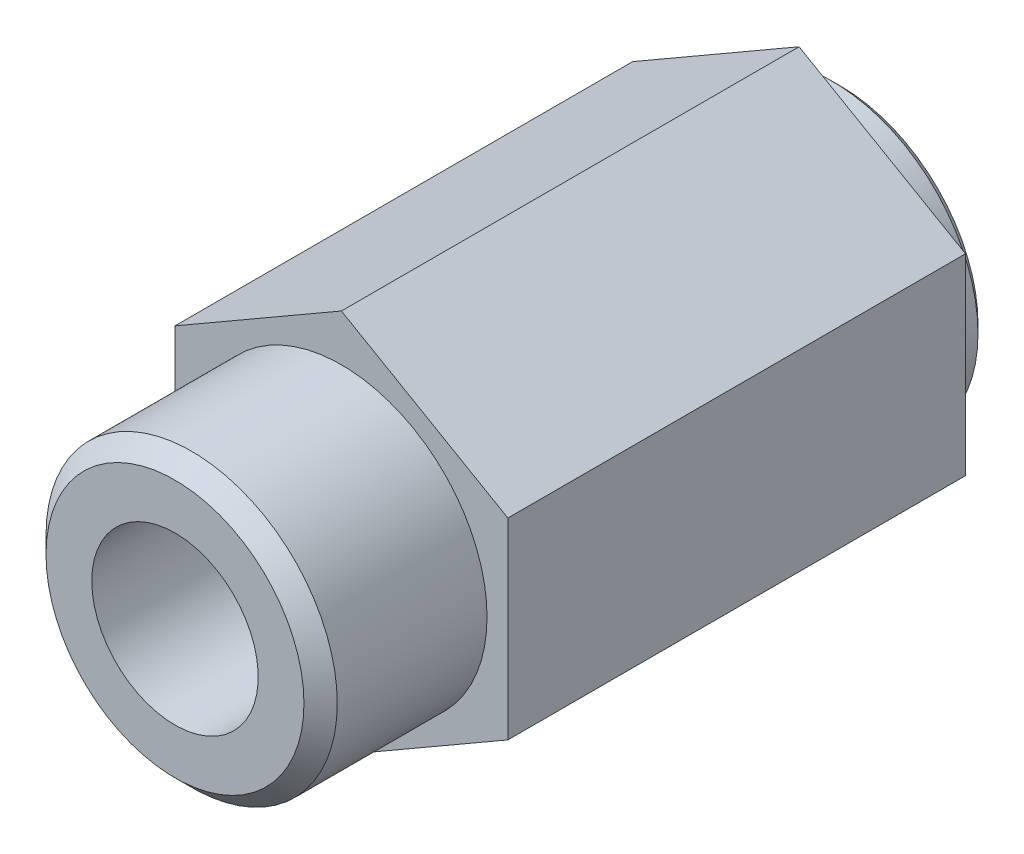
from build123d import *

# Parameters (mm, degrees)
EXTRUDE_1_DEPTH     = 55
SKETCH_2_R          = 17.5
EXTRUDE_2_DEPTH     = 20
EXTRUDE_START       = 5
SKETCH_3_R          = 17.5
EXTRUDE_3_DEPTH     = 5
SKETCH_4_R          = 10
CUT_EXTRUDE_2_DEPTH = 80
CHAMFER_1_SIZE      = 2
CHAMFER_2_SIZE      = 1


with BuildPart() as part:
    # Sketch 1 → Extrude 1 (new body)
    with BuildSketch(Plane.XY):
        Polygon((0, 23.094010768), (-20, 11.547005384), (-20, -11.547005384), (0, -23.094010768), (20, -11.547005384), (20, 11.547005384), align=None)
    extrude(amount=EXTRUDE_1_DEPTH)

    # Sketch 2 → Extrude 2 (add)
    with BuildSketch(Plane.XY.offset(55)):
        Circle(SKETCH_2_R)
    extrude(amount=EXTRUDE_2_DEPTH)

    # Sketch 3 → Extrude 3 (add)
    with BuildSketch(Plane(origin=(0, 0, 0), x_dir=(-1, 0, 0), z_dir=(0, 0, -1)).offset(EXTRUDE_START)):
        with Locations(Location((0, 0, 0), (0, 0, 180))):
            Circle(SKETCH_3_R)
    extrude(amount=-EXTRUDE_3_DEPTH)

    # Sketch 4 → Cut-Extrude 2 (cut)
    with BuildSketch(Plane(origin=(0, 0, -5), x_dir=(-1, 0, 0), z_dir=(0, 0, -1))):
        Circle(SKETCH_4_R)
    extrude(amount=-CUT_EXTRUDE_2_DEPTH, mode=Mode.SUBTRACT)

    # Chamfer 1
    chamfer_1_edges = [part.edges().sort_by_distance(p)[0] for p in [
        (-17.5, 0, 75),
    ]]
    chamfer(chamfer_1_edges, length=CHAMFER_1_SIZE)

    # Chamfer 2
    chamfer_2_edges = [part.edges().sort_by_distance(p)[0] for p in [
        (-17.5, 0, -5),
    ]]
    chamfer(chamfer_2_edges, length=CHAMFER_2_SIZE)


solid = part.part
